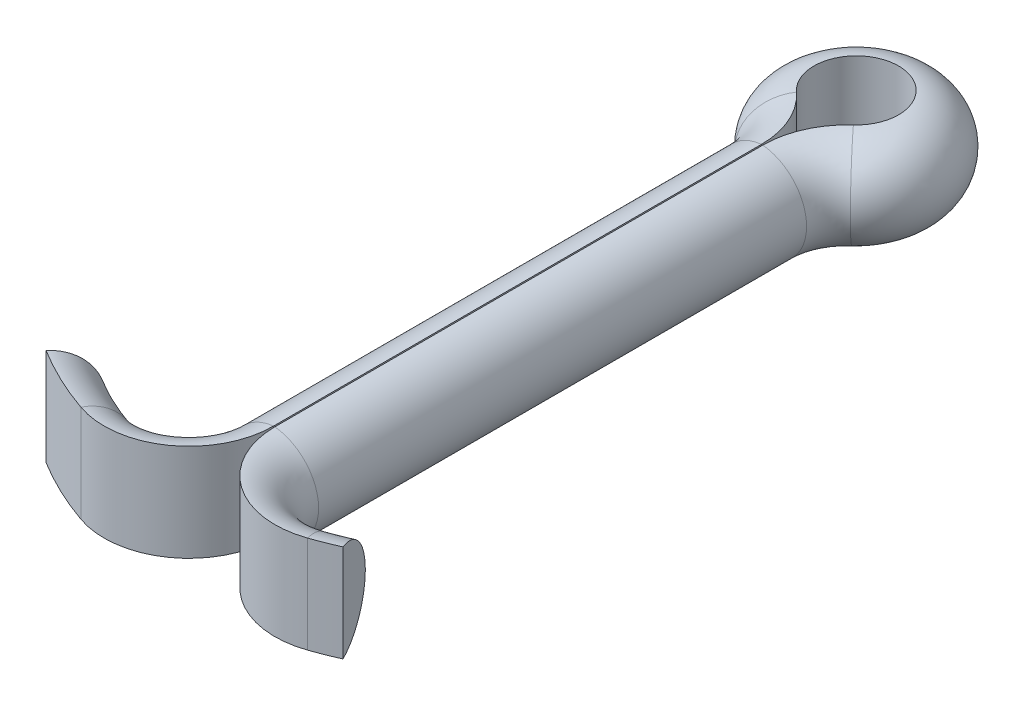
ISO-10303-21;
HEADER;
FILE_DESCRIPTION(('STEP AP214'),'2;1');
FILE_NAME('part.step','',(''),(''),'','','');
FILE_SCHEMA(('AUTOMOTIVE_DESIGN { 1 0 10303 214 1 1 1 1 }'));
ENDSEC;
DATA;
#1=APPLICATION_CONTEXT('core data for automotive mechanical design processes');
#2=APPLICATION_PROTOCOL_DEFINITION('international standard','automotive_design',2000,#1);
#3=PRODUCT_CONTEXT('',#1,'mechanical');
#4=PRODUCT('Part','Part','',(#3));
#5=PRODUCT_RELATED_PRODUCT_CATEGORY('part','',(#4));
#6=PRODUCT_DEFINITION_FORMATION('','',#4);
#7=PRODUCT_DEFINITION_CONTEXT('part definition',#1,'design');
#8=PRODUCT_DEFINITION('design','',#6,#7);
#9=PRODUCT_DEFINITION_SHAPE('','',#8);
#10=(LENGTH_UNIT() NAMED_UNIT(*) SI_UNIT(.MILLI.,.METRE.));
#11=(NAMED_UNIT(*) PLANE_ANGLE_UNIT() SI_UNIT($,.RADIAN.));
#12=(NAMED_UNIT(*) SI_UNIT($,.STERADIAN.) SOLID_ANGLE_UNIT());
#13=UNCERTAINTY_MEASURE_WITH_UNIT(LENGTH_MEASURE(1.E-05),#10,'distance_accuracy_value','');
#14=(GEOMETRIC_REPRESENTATION_CONTEXT(3) GLOBAL_UNCERTAINTY_ASSIGNED_CONTEXT((#13)) GLOBAL_UNIT_ASSIGNED_CONTEXT((#10,
#11,#12)) REPRESENTATION_CONTEXT('',''));
#15=CARTESIAN_POINT('',(0.,0.,0.));
#16=DIRECTION('',(0.,0.,1.));
#17=DIRECTION('',(1.,0.,0.));
#18=AXIS2_PLACEMENT_3D('',#15,#16,#17);
#19=CARTESIAN_POINT('',(0.,0.,0.));
#20=DIRECTION('',(0.,1.,0.));
#21=DIRECTION('',(0.,0.,1.));
#22=AXIS2_PLACEMENT_3D('',#19,#20,#21);
#23=CYLINDRICAL_SURFACE('',#22,6.43144715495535);
#24=DIRECTION('',(0.,1.,0.));
#25=VECTOR('',#24,1.);
#26=CARTESIAN_POINT('',(2.12463129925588,-0.909444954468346,6.07037514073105));
#27=LINE('',#26,#25);
#28=CARTESIAN_POINT('',(2.12463129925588,-0.909444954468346,6.07037514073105));
#29=VERTEX_POINT('',#28);
#30=CARTESIAN_POINT('',(2.12463129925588,0.909444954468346,6.07037514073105));
#31=VERTEX_POINT('',#30);
#32=EDGE_CURVE('E210',#29,#31,#27,.T.);
#33=ORIENTED_EDGE('',*,*,#32,.F.);
#34=CARTESIAN_POINT('',(0.,-0.909444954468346,0.));
#35=DIRECTION('',(0.,1.,0.));
#36=DIRECTION('',(0.,0.,1.));
#37=AXIS2_PLACEMENT_3D('',#34,#35,#36);
#38=CIRCLE('',#37,6.43144715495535);
#39=CARTESIAN_POINT('',(2.59955848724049,-0.909444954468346,5.88267015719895));
#40=VERTEX_POINT('',#39);
#41=EDGE_CURVE('E42',#29,#40,#38,.T.);
#42=ORIENTED_EDGE('',*,*,#41,.T.);
#43=DIRECTION('',(0.,1.,0.));
#44=VECTOR('',#43,1.);
#45=CARTESIAN_POINT('',(2.59955848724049,-0.909444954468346,5.88267015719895));
#46=LINE('',#45,#44);
#47=CARTESIAN_POINT('',(2.59955848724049,0.909444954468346,5.88267015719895));
#48=VERTEX_POINT('',#47);
#49=EDGE_CURVE('E49',#40,#48,#46,.T.);
#50=ORIENTED_EDGE('',*,*,#49,.T.);
#51=CARTESIAN_POINT('',(0.,0.909444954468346,0.));
#52=DIRECTION('',(0.,1.,0.));
#53=DIRECTION('',(0.,0.,1.));
#54=AXIS2_PLACEMENT_3D('',#51,#52,#53);
#55=CIRCLE('',#54,6.43144715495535);
#56=EDGE_CURVE('E11',#31,#48,#55,.T.);
#57=ORIENTED_EDGE('',*,*,#56,.F.);
#58=EDGE_LOOP('',(#33,#42,#50,#57));
#59=FACE_BOUND('',#58,.T.);
#60=ADVANCED_FACE('F35',(#59),#23,.T.);
#61=CARTESIAN_POINT('',(0.,0.,0.));
#62=DIRECTION('',(0.,1.,0.));
#63=DIRECTION('',(0.,0.,1.));
#64=AXIS2_PLACEMENT_3D('',#61,#62,#63);
#65=TOROIDAL_SURFACE('',#64,6.52651152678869,0.9144);
#66=CARTESIAN_POINT('',(2.15603585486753,0.,6.16010244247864));
#67=DIRECTION('',(-0.943858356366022,0.,0.330350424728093));
#68=DIRECTION('',(-0.330350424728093,0.,-0.943858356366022));
#69=AXIS2_PLACEMENT_3D('',#66,#67,#68);
#70=CIRCLE('',#69,0.9144);
#71=EDGE_CURVE('E207',#31,#29,#70,.T.);
#72=ORIENTED_EDGE('',*,*,#71,.F.);
#73=ORIENTED_EDGE('',*,*,#56,.T.);
#74=CARTESIAN_POINT('',(2.63798302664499,0.,5.96962295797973));
#75=DIRECTION('',(-0.914672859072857,0.,0.404194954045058));
#76=DIRECTION('',(-0.404194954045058,0.,-0.914672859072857));
#77=AXIS2_PLACEMENT_3D('',#74,#75,#76);
#78=CIRCLE('',#77,0.9144);
#79=EDGE_CURVE('E55',#48,#40,#78,.T.);
#80=ORIENTED_EDGE('',*,*,#79,.T.);
#81=ORIENTED_EDGE('',*,*,#41,.F.);
#82=EDGE_LOOP('',(#72,#73,#80,#81));
#83=FACE_BOUND('',#82,.T.);
#84=ADVANCED_FACE('F222',(#83),#65,.T.);
#85=CARTESIAN_POINT('',(1.6002,0.,4.572));
#86=DIRECTION('',(0.,1.,0.));
#87=DIRECTION('',(0.,0.,1.));
#88=AXIS2_PLACEMENT_3D('',#85,#86,#87);
#89=CYLINDRICAL_SURFACE('',#88,1.5875);
#90=DIRECTION('',(0.,1.,0.));
#91=VECTOR('',#90,1.);
#92=CARTESIAN_POINT('',(0.0127000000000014,-0.909444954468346,4.57200000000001));
#93=LINE('',#92,#91);
#94=CARTESIAN_POINT('',(0.0127000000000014,-0.909444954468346,4.57200000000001));
#95=VERTEX_POINT('',#94);
#96=CARTESIAN_POINT('',(0.0127000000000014,0.909444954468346,4.57200000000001));
#97=VERTEX_POINT('',#96);
#98=EDGE_CURVE('E198',#95,#97,#93,.T.);
#99=ORIENTED_EDGE('',*,*,#98,.F.);
#100=CARTESIAN_POINT('',(1.6002,-0.909444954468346,4.572));
#101=DIRECTION('',(0.,1.,0.));
#102=DIRECTION('',(0.,0.,1.));
#103=AXIS2_PLACEMENT_3D('',#100,#101,#102);
#104=CIRCLE('',#103,1.5875);
#105=EDGE_CURVE('E213',#95,#29,#104,.T.);
#106=ORIENTED_EDGE('',*,*,#105,.T.);
#107=ORIENTED_EDGE('',*,*,#32,.T.);
#108=CARTESIAN_POINT('',(1.6002,0.909444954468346,4.572));
#109=DIRECTION('',(0.,1.,0.));
#110=DIRECTION('',(0.,0.,1.));
#111=AXIS2_PLACEMENT_3D('',#108,#109,#110);
#112=CIRCLE('',#111,1.5875);
#113=EDGE_CURVE('E216',#97,#31,#112,.T.);
#114=ORIENTED_EDGE('',*,*,#113,.F.);
#115=EDGE_LOOP('',(#99,#106,#107,#114));
#116=FACE_BOUND('',#115,.T.);
#117=ADVANCED_FACE('F226',(#116),#89,.T.);
#118=CARTESIAN_POINT('',(1.6002,0.,4.572));
#119=DIRECTION('',(0.,1.,0.));
#120=DIRECTION('',(0.,0.,1.));
#121=AXIS2_PLACEMENT_3D('',#118,#119,#120);
#122=TOROIDAL_SURFACE('',#121,1.68256437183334,0.9144);
#123=CARTESIAN_POINT('',(-0.0823643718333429,0.,4.57200000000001));
#124=DIRECTION('',(0.,0.,-1.));
#125=DIRECTION('',(1.,0.,0.));
#126=AXIS2_PLACEMENT_3D('',#123,#124,#125);
#127=CIRCLE('',#126,0.9144);
#128=EDGE_CURVE('E195',#97,#95,#127,.T.);
#129=ORIENTED_EDGE('',*,*,#128,.F.);
#130=ORIENTED_EDGE('',*,*,#113,.T.);
#131=ORIENTED_EDGE('',*,*,#71,.T.);
#132=ORIENTED_EDGE('',*,*,#105,.F.);
#133=EDGE_LOOP('',(#129,#130,#131,#132));
#134=FACE_BOUND('',#133,.T.);
#135=ADVANCED_FACE('F228',(#134),#122,.T.);
#136=CARTESIAN_POINT('',(0.0127000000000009,-0.909444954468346,-4.57198236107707));
#137=DIRECTION('',(1.,0.,0.));
#138=DIRECTION('',(0.,0.,-1.));
#139=AXIS2_PLACEMENT_3D('',#136,#137,#138);
#140=PLANE('',#139);
#141=DIRECTION('',(0.,1.,0.));
#142=VECTOR('',#141,1.);
#143=CARTESIAN_POINT('',(0.0127000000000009,-0.909444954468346,-4.57198236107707));
#144=LINE('',#143,#142);
#145=CARTESIAN_POINT('',(0.0127000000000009,-0.909444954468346,-4.57198236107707));
#146=VERTEX_POINT('',#145);
#147=CARTESIAN_POINT('',(0.0127000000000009,0.909444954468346,-4.57198236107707));
#148=VERTEX_POINT('',#147);
#149=EDGE_CURVE('E186',#146,#148,#144,.T.);
#150=ORIENTED_EDGE('',*,*,#149,.F.);
#151=DIRECTION('',(0.,0.,1.));
#152=VECTOR('',#151,1.);
#153=CARTESIAN_POINT('',(0.0127000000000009,-0.909444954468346,-4.57198236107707));
#154=LINE('',#153,#152);
#155=EDGE_CURVE('E201',#146,#95,#154,.T.);
#156=ORIENTED_EDGE('',*,*,#155,.T.);
#157=ORIENTED_EDGE('',*,*,#98,.T.);
#158=DIRECTION('',(0.,0.,1.));
#159=VECTOR('',#158,1.);
#160=CARTESIAN_POINT('',(0.0127000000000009,0.909444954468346,-4.57198236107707));
#161=LINE('',#160,#159);
#162=EDGE_CURVE('E204',#148,#97,#161,.T.);
#163=ORIENTED_EDGE('',*,*,#162,.F.);
#164=EDGE_LOOP('',(#150,#156,#157,#163));
#165=FACE_BOUND('',#164,.T.);
#166=ADVANCED_FACE('F232',(#165),#140,.F.);
#167=CARTESIAN_POINT('',(-0.0823643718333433,0.,-4.57198236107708));
#168=DIRECTION('',(0.,0.,1.));
#169=DIRECTION('',(1.,0.,0.));
#170=AXIS2_PLACEMENT_3D('',#167,#168,#169);
#171=CYLINDRICAL_SURFACE('',#170,0.9144);
#172=CARTESIAN_POINT('',(-0.0823643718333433,0.,-4.57198236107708));
#173=DIRECTION('',(0.,0.,-1.));
#174=DIRECTION('',(1.,0.,0.));
#175=AXIS2_PLACEMENT_3D('',#172,#173,#174);
#176=CIRCLE('',#175,0.9144);
#177=EDGE_CURVE('E183',#148,#146,#176,.T.);
#178=ORIENTED_EDGE('',*,*,#177,.F.);
#179=ORIENTED_EDGE('',*,*,#162,.T.);
#180=ORIENTED_EDGE('',*,*,#128,.T.);
#181=ORIENTED_EDGE('',*,*,#155,.F.);
#182=EDGE_LOOP('',(#178,#179,#180,#181));
#183=FACE_BOUND('',#182,.T.);
#184=ADVANCED_FACE('F234',(#183),#171,.T.);
#185=CARTESIAN_POINT('',(1.6002,0.,-4.57198236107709));
#186=DIRECTION('',(0.,1.,0.));
#187=DIRECTION('',(0.,0.,1.));
#188=AXIS2_PLACEMENT_3D('',#185,#186,#187);
#189=CYLINDRICAL_SURFACE('',#188,1.5875);
#190=DIRECTION('',(0.,1.,0.));
#191=VECTOR('',#190,1.);
#192=CARTESIAN_POINT('',(0.533399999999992,-0.909444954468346,-5.74760730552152));
#193=LINE('',#192,#191);
#194=CARTESIAN_POINT('',(0.533399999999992,-0.909444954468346,-5.74760730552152));
#195=VERTEX_POINT('',#194);
#196=CARTESIAN_POINT('',(0.533399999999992,0.909444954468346,-5.74760730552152));
#197=VERTEX_POINT('',#196);
#198=EDGE_CURVE('E174',#195,#197,#193,.T.);
#199=ORIENTED_EDGE('',*,*,#198,.F.);
#200=CARTESIAN_POINT('',(1.6002,-0.909444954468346,-4.57198236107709));
#201=DIRECTION('',(0.,1.,0.));
#202=DIRECTION('',(0.,0.,1.));
#203=AXIS2_PLACEMENT_3D('',#200,#201,#202);
#204=CIRCLE('',#203,1.5875);
#205=EDGE_CURVE('E189',#195,#146,#204,.T.);
#206=ORIENTED_EDGE('',*,*,#205,.T.);
#207=ORIENTED_EDGE('',*,*,#149,.T.);
#208=CARTESIAN_POINT('',(1.6002,0.909444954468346,-4.57198236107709));
#209=DIRECTION('',(0.,1.,0.));
#210=DIRECTION('',(0.,0.,1.));
#211=AXIS2_PLACEMENT_3D('',#208,#209,#210);
#212=CIRCLE('',#211,1.5875);
#213=EDGE_CURVE('E192',#197,#148,#212,.T.);
#214=ORIENTED_EDGE('',*,*,#213,.F.);
#215=EDGE_LOOP('',(#199,#206,#207,#214));
#216=FACE_BOUND('',#215,.T.);
#217=ADVANCED_FACE('F238',(#216),#189,.T.);
#218=CARTESIAN_POINT('',(1.6002,0.,-4.57198236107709));
#219=DIRECTION('',(0.,1.,0.));
#220=DIRECTION('',(0.,0.,1.));
#221=AXIS2_PLACEMENT_3D('',#218,#219,#220);
#222=TOROIDAL_SURFACE('',#221,1.68256437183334,0.9144);
#223=CARTESIAN_POINT('',(0.469516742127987,0.,-5.81800733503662));
#224=DIRECTION('',(0.740551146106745,0.,-0.67199999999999));
#225=DIRECTION('',(0.67199999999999,0.,0.740551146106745));
#226=AXIS2_PLACEMENT_3D('',#223,#224,#225);
#227=CIRCLE('',#226,0.9144);
#228=EDGE_CURVE('E171',#197,#195,#227,.T.);
#229=ORIENTED_EDGE('',*,*,#228,.F.);
#230=ORIENTED_EDGE('',*,*,#213,.T.);
#231=ORIENTED_EDGE('',*,*,#177,.T.);
#232=ORIENTED_EDGE('',*,*,#205,.F.);
#233=EDGE_LOOP('',(#229,#230,#231,#232));
#234=FACE_BOUND('',#233,.T.);
#235=ADVANCED_FACE('F240',(#234),#222,.T.);
#236=CARTESIAN_POINT('',(0.,0.,-6.33541977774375));
#237=DIRECTION('',(0.,-1.,0.));
#238=DIRECTION('',(0.,0.,-1.));
#239=AXIS2_PLACEMENT_3D('',#236,#237,#238);
#240=CYLINDRICAL_SURFACE('',#239,0.79375);
#241=DIRECTION('',(0.,1.,0.));
#242=VECTOR('',#241,1.);
#243=CARTESIAN_POINT('',(-0.533400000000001,-0.909444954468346,-5.74760730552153));
#244=LINE('',#243,#242);
#245=CARTESIAN_POINT('',(-0.533400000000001,-0.909444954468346,-5.74760730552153));
#246=VERTEX_POINT('',#245);
#247=CARTESIAN_POINT('',(-0.533400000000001,0.909444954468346,-5.74760730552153));
#248=VERTEX_POINT('',#247);
#249=EDGE_CURVE('E162',#246,#248,#244,.T.);
#250=ORIENTED_EDGE('',*,*,#249,.F.);
#251=CARTESIAN_POINT('',(0.,-0.909444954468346,-6.33541977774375));
#252=DIRECTION('',(0.,-1.,0.));
#253=DIRECTION('',(0.,0.,-1.));
#254=AXIS2_PLACEMENT_3D('',#251,#252,#253);
#255=CIRCLE('',#254,0.79375);
#256=EDGE_CURVE('E177',#246,#195,#255,.T.);
#257=ORIENTED_EDGE('',*,*,#256,.T.);
#258=ORIENTED_EDGE('',*,*,#198,.T.);
#259=CARTESIAN_POINT('',(0.,0.909444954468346,-6.33541977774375));
#260=DIRECTION('',(0.,-1.,0.));
#261=DIRECTION('',(0.,0.,-1.));
#262=AXIS2_PLACEMENT_3D('',#259,#260,#261);
#263=CIRCLE('',#262,0.79375);
#264=EDGE_CURVE('E180',#248,#197,#263,.T.);
#265=ORIENTED_EDGE('',*,*,#264,.F.);
#266=EDGE_LOOP('',(#250,#257,#258,#265));
#267=FACE_BOUND('',#266,.T.);
#268=ADVANCED_FACE('F244',(#267),#240,.F.);
#269=CARTESIAN_POINT('',(0.,0.,-6.33541977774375));
#270=DIRECTION('',(0.,-1.,0.));
#271=DIRECTION('',(0.,0.,-1.));
#272=AXIS2_PLACEMENT_3D('',#269,#270,#271);
#273=DEGENERATE_TOROIDAL_SURFACE('',#272,0.698685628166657,0.9144,.T.);
#274=CARTESIAN_POINT('',(-0.469516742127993,0.,-5.81800733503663));
#275=DIRECTION('',(0.740551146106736,0.,0.672));
#276=DIRECTION('',(-0.672,0.,0.740551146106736));
#277=AXIS2_PLACEMENT_3D('',#274,#275,#276);
#278=CIRCLE('',#277,0.9144);
#279=EDGE_CURVE('E159',#248,#246,#278,.T.);
#280=ORIENTED_EDGE('',*,*,#279,.F.);
#281=ORIENTED_EDGE('',*,*,#264,.T.);
#282=ORIENTED_EDGE('',*,*,#228,.T.);
#283=ORIENTED_EDGE('',*,*,#256,.F.);
#284=EDGE_LOOP('',(#280,#281,#282,#283));
#285=FACE_BOUND('',#284,.T.);
#286=ADVANCED_FACE('F246',(#285),#273,.T.);
#287=CARTESIAN_POINT('',(-1.6002,0.,-4.57198236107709));
#288=DIRECTION('',(0.,1.,0.));
#289=DIRECTION('',(0.,0.,1.));
#290=AXIS2_PLACEMENT_3D('',#287,#288,#289);
#291=CYLINDRICAL_SURFACE('',#290,1.5875);
#292=DIRECTION('',(0.,1.,0.));
#293=VECTOR('',#292,1.);
#294=CARTESIAN_POINT('',(-0.0127000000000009,-0.909444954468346,-4.57198236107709));
#295=LINE('',#294,#293);
#296=CARTESIAN_POINT('',(-0.0127000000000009,-0.909444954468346,-4.57198236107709));
#297=VERTEX_POINT('',#296);
#298=CARTESIAN_POINT('',(-0.0127000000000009,0.909444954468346,-4.57198236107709));
#299=VERTEX_POINT('',#298);
#300=EDGE_CURVE('E150',#297,#299,#295,.T.);
#301=ORIENTED_EDGE('',*,*,#300,.F.);
#302=CARTESIAN_POINT('',(-1.6002,-0.909444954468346,-4.57198236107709));
#303=DIRECTION('',(0.,1.,0.));
#304=DIRECTION('',(0.,0.,1.));
#305=AXIS2_PLACEMENT_3D('',#302,#303,#304);
#306=CIRCLE('',#305,1.5875);
#307=EDGE_CURVE('E165',#297,#246,#306,.T.);
#308=ORIENTED_EDGE('',*,*,#307,.T.);
#309=ORIENTED_EDGE('',*,*,#249,.T.);
#310=CARTESIAN_POINT('',(-1.6002,0.909444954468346,-4.57198236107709));
#311=DIRECTION('',(0.,1.,0.));
#312=DIRECTION('',(0.,0.,1.));
#313=AXIS2_PLACEMENT_3D('',#310,#311,#312);
#314=CIRCLE('',#313,1.5875);
#315=EDGE_CURVE('E168',#299,#248,#314,.T.);
#316=ORIENTED_EDGE('',*,*,#315,.F.);
#317=EDGE_LOOP('',(#301,#308,#309,#316));
#318=FACE_BOUND('',#317,.T.);
#319=ADVANCED_FACE('F250',(#318),#291,.T.);
#320=CARTESIAN_POINT('',(-1.6002,0.,-4.57198236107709));
#321=DIRECTION('',(0.,1.,0.));
#322=DIRECTION('',(0.,0.,1.));
#323=AXIS2_PLACEMENT_3D('',#320,#321,#322);
#324=TOROIDAL_SURFACE('',#323,1.68256437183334,0.9144);
#325=CARTESIAN_POINT('',(0.0823643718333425,0.,-4.57198236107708));
#326=DIRECTION('',(0.,0.,1.));
#327=DIRECTION('',(-1.,0.,0.));
#328=AXIS2_PLACEMENT_3D('',#325,#326,#327);
#329=CIRCLE('',#328,0.9144);
#330=EDGE_CURVE('E147',#299,#297,#329,.T.);
#331=ORIENTED_EDGE('',*,*,#330,.F.);
#332=ORIENTED_EDGE('',*,*,#315,.T.);
#333=ORIENTED_EDGE('',*,*,#279,.T.);
#334=ORIENTED_EDGE('',*,*,#307,.F.);
#335=EDGE_LOOP('',(#331,#332,#333,#334));
#336=FACE_BOUND('',#335,.T.);
#337=ADVANCED_FACE('F252',(#336),#324,.T.);
#338=CARTESIAN_POINT('',(-0.0127000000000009,-0.909444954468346,4.572));
#339=DIRECTION('',(-1.,0.,0.));
#340=DIRECTION('',(0.,0.,1.));
#341=AXIS2_PLACEMENT_3D('',#338,#339,#340);
#342=PLANE('',#341);
#343=DIRECTION('',(0.,1.,0.));
#344=VECTOR('',#343,1.);
#345=CARTESIAN_POINT('',(-0.0127000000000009,-0.909444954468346,4.572));
#346=LINE('',#345,#344);
#347=CARTESIAN_POINT('',(-0.0127000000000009,-0.909444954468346,4.572));
#348=VERTEX_POINT('',#347);
#349=CARTESIAN_POINT('',(-0.0127000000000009,0.909444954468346,4.572));
#350=VERTEX_POINT('',#349);
#351=EDGE_CURVE('E138',#348,#350,#346,.T.);
#352=ORIENTED_EDGE('',*,*,#351,.F.);
#353=DIRECTION('',(0.,0.,-1.));
#354=VECTOR('',#353,1.);
#355=CARTESIAN_POINT('',(-0.0127000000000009,-0.909444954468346,4.572));
#356=LINE('',#355,#354);
#357=EDGE_CURVE('E153',#348,#297,#356,.T.);
#358=ORIENTED_EDGE('',*,*,#357,.T.);
#359=ORIENTED_EDGE('',*,*,#300,.T.);
#360=DIRECTION('',(0.,0.,-1.));
#361=VECTOR('',#360,1.);
#362=CARTESIAN_POINT('',(-0.0127000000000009,0.909444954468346,4.572));
#363=LINE('',#362,#361);
#364=EDGE_CURVE('E156',#350,#299,#363,.T.);
#365=ORIENTED_EDGE('',*,*,#364,.F.);
#366=EDGE_LOOP('',(#352,#358,#359,#365));
#367=FACE_BOUND('',#366,.T.);
#368=ADVANCED_FACE('F256',(#367),#342,.F.);
#369=CARTESIAN_POINT('',(0.0823643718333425,0.,4.572));
#370=DIRECTION('',(0.,0.,-1.));
#371=DIRECTION('',(-1.,0.,0.));
#372=AXIS2_PLACEMENT_3D('',#369,#370,#371);
#373=CYLINDRICAL_SURFACE('',#372,0.9144);
#374=CARTESIAN_POINT('',(0.0823643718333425,0.,4.572));
#375=DIRECTION('',(0.,0.,1.));
#376=DIRECTION('',(-1.,0.,0.));
#377=AXIS2_PLACEMENT_3D('',#374,#375,#376);
#378=CIRCLE('',#377,0.9144);
#379=EDGE_CURVE('E135',#350,#348,#378,.T.);
#380=ORIENTED_EDGE('',*,*,#379,.F.);
#381=ORIENTED_EDGE('',*,*,#364,.T.);
#382=ORIENTED_EDGE('',*,*,#330,.T.);
#383=ORIENTED_EDGE('',*,*,#357,.F.);
#384=EDGE_LOOP('',(#380,#381,#382,#383));
#385=FACE_BOUND('',#384,.T.);
#386=ADVANCED_FACE('F258',(#385),#373,.T.);
#387=CARTESIAN_POINT('',(-1.6002,0.,4.572));
#388=DIRECTION('',(0.,1.,0.));
#389=DIRECTION('',(0.,0.,1.));
#390=AXIS2_PLACEMENT_3D('',#387,#388,#389);
#391=CYLINDRICAL_SURFACE('',#390,1.5875);
#392=DIRECTION('',(0.,1.,0.));
#393=VECTOR('',#392,1.);
#394=CARTESIAN_POINT('',(-2.12463129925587,-0.909444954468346,6.07037514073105));
#395=LINE('',#394,#393);
#396=CARTESIAN_POINT('',(-2.12463129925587,-0.909444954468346,6.07037514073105));
#397=VERTEX_POINT('',#396);
#398=CARTESIAN_POINT('',(-2.12463129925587,0.909444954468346,6.07037514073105));
#399=VERTEX_POINT('',#398);
#400=EDGE_CURVE('E122',#397,#399,#395,.T.);
#401=ORIENTED_EDGE('',*,*,#400,.F.);
#402=CARTESIAN_POINT('',(-1.6002,-0.909444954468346,4.572));
#403=DIRECTION('',(0.,1.,0.));
#404=DIRECTION('',(0.,0.,1.));
#405=AXIS2_PLACEMENT_3D('',#402,#403,#404);
#406=CIRCLE('',#405,1.5875);
#407=EDGE_CURVE('E141',#397,#348,#406,.T.);
#408=ORIENTED_EDGE('',*,*,#407,.T.);
#409=ORIENTED_EDGE('',*,*,#351,.T.);
#410=CARTESIAN_POINT('',(-1.6002,0.909444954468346,4.572));
#411=DIRECTION('',(0.,1.,0.));
#412=DIRECTION('',(0.,0.,1.));
#413=AXIS2_PLACEMENT_3D('',#410,#411,#412);
#414=CIRCLE('',#413,1.5875);
#415=EDGE_CURVE('E144',#399,#350,#414,.T.);
#416=ORIENTED_EDGE('',*,*,#415,.F.);
#417=EDGE_LOOP('',(#401,#408,#409,#416));
#418=FACE_BOUND('',#417,.T.);
#419=ADVANCED_FACE('F262',(#418),#391,.T.);
#420=CARTESIAN_POINT('',(-1.6002,0.,4.572));
#421=DIRECTION('',(0.,1.,0.));
#422=DIRECTION('',(0.,0.,1.));
#423=AXIS2_PLACEMENT_3D('',#420,#421,#422);
#424=TOROIDAL_SURFACE('',#423,1.68256437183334,0.9144);
#425=CARTESIAN_POINT('',(-2.15603585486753,0.,6.16010244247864));
#426=DIRECTION('',(-0.943858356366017,0.,-0.330350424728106));
#427=DIRECTION('',(0.330350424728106,0.,-0.943858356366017));
#428=AXIS2_PLACEMENT_3D('',#425,#426,#427);
#429=CIRCLE('',#428,0.9144);
#430=EDGE_CURVE('E118',#399,#397,#429,.T.);
#431=ORIENTED_EDGE('',*,*,#430,.F.);
#432=ORIENTED_EDGE('',*,*,#415,.T.);
#433=ORIENTED_EDGE('',*,*,#379,.T.);
#434=ORIENTED_EDGE('',*,*,#407,.F.);
#435=EDGE_LOOP('',(#431,#432,#433,#434));
#436=FACE_BOUND('',#435,.T.);
#437=ADVANCED_FACE('F263',(#436),#424,.T.);
#438=CARTESIAN_POINT('',(0.,0.,0.));
#439=DIRECTION('',(0.,-1.,0.));
#440=DIRECTION('',(0.,0.,-1.));
#441=AXIS2_PLACEMENT_3D('',#438,#439,#440);
#442=TOROIDAL_SURFACE('',#441,6.52651152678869,0.9144);
#443=CARTESIAN_POINT('',(0.,0.909444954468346,0.));
#444=DIRECTION('',(0.,-1.,0.));
#445=DIRECTION('',(0.,0.,-1.));
#446=AXIS2_PLACEMENT_3D('',#443,#444,#445);
#447=CIRCLE('',#446,6.43144715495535);
#448=CARTESIAN_POINT('',(-3.37138044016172,0.909444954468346,5.47697968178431));
#449=VERTEX_POINT('',#448);
#450=EDGE_CURVE('E121',#399,#449,#447,.T.);
#451=ORIENTED_EDGE('',*,*,#450,.F.);
#452=ORIENTED_EDGE('',*,*,#430,.T.);
#453=CARTESIAN_POINT('',(0.,-0.909444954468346,0.));
#454=DIRECTION('',(0.,-1.,0.));
#455=DIRECTION('',(0.,0.,-1.));
#456=AXIS2_PLACEMENT_3D('',#453,#454,#455);
#457=CIRCLE('',#456,6.43144715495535);
#458=CARTESIAN_POINT('',(-3.37138044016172,-0.909444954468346,5.47697968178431));
#459=VERTEX_POINT('',#458);
#460=EDGE_CURVE('E111',#397,#459,#457,.T.);
#461=ORIENTED_EDGE('',*,*,#460,.T.);
#462=CARTESIAN_POINT('',(-3.42121341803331,0.,5.55793589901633));
#463=DIRECTION('',(-0.851593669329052,0.,-0.524202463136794));
#464=DIRECTION('',(0.524202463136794,0.,-0.851593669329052));
#465=AXIS2_PLACEMENT_3D('',#462,#463,#464);
#466=CIRCLE('',#465,0.9144);
#467=EDGE_CURVE('E116',#449,#459,#466,.T.);
#468=ORIENTED_EDGE('',*,*,#467,.F.);
#469=EDGE_LOOP('',(#451,#452,#461,#468));
#470=FACE_BOUND('',#469,.T.);
#471=ADVANCED_FACE('F114',(#470),#442,.T.);
#472=CARTESIAN_POINT('',(0.,0.,0.));
#473=DIRECTION('',(0.,-1.,0.));
#474=DIRECTION('',(0.,0.,-1.));
#475=AXIS2_PLACEMENT_3D('',#472,#473,#474);
#476=CYLINDRICAL_SURFACE('',#475,6.43144715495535);
#477=ORIENTED_EDGE('',*,*,#400,.T.);
#478=ORIENTED_EDGE('',*,*,#450,.T.);
#479=DIRECTION('',(0.,1.,0.));
#480=VECTOR('',#479,1.);
#481=CARTESIAN_POINT('',(-3.37138044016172,-0.909444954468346,5.47697968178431));
#482=LINE('',#481,#480);
#483=EDGE_CURVE('E125',#459,#449,#482,.T.);
#484=ORIENTED_EDGE('',*,*,#483,.F.);
#485=ORIENTED_EDGE('',*,*,#460,.F.);
#486=EDGE_LOOP('',(#477,#478,#484,#485));
#487=FACE_BOUND('',#486,.T.);
#488=ADVANCED_FACE('F126',(#487),#476,.T.);
#489=CARTESIAN_POINT('',(2.63798302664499,0.,5.96962295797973));
#490=DIRECTION('',(0.914672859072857,0.,-0.404194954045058));
#491=DIRECTION('',(-0.404194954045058,0.,-0.914672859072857));
#492=AXIS2_PLACEMENT_3D('',#489,#490,#491);
#493=PLANE('',#492);
#494=ORIENTED_EDGE('',*,*,#79,.F.);
#495=ORIENTED_EDGE('',*,*,#49,.F.);
#496=EDGE_LOOP('',(#494,#495));
#497=FACE_BOUND('',#496,.T.);
#498=ADVANCED_FACE('F330',(#497),#493,.T.);
#499=CARTESIAN_POINT('',(-3.42121341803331,0.,5.55793589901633));
#500=DIRECTION('',(0.851593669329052,0.,0.524202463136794));
#501=DIRECTION('',(0.524202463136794,0.,-0.851593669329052));
#502=AXIS2_PLACEMENT_3D('',#499,#500,#501);
#503=PLANE('',#502);
#504=ORIENTED_EDGE('',*,*,#467,.T.);
#505=ORIENTED_EDGE('',*,*,#483,.T.);
#506=EDGE_LOOP('',(#504,#505));
#507=FACE_BOUND('',#506,.T.);
#508=ADVANCED_FACE('F129',(#507),#503,.F.);
#509=CLOSED_SHELL('',(#60,#84,#117,#135,#166,#184,#217,#235,#268,#286,#319,#337,#368,#386,#419,
#437,#471,#488,#498,#508));
#510=MANIFOLD_SOLID_BREP('B2',#509);
#511=ADVANCED_BREP_SHAPE_REPRESENTATION('',(#18,#510),#14);
#512=SHAPE_DEFINITION_REPRESENTATION(#9,#511);
ENDSEC;
END-ISO-10303-21;
